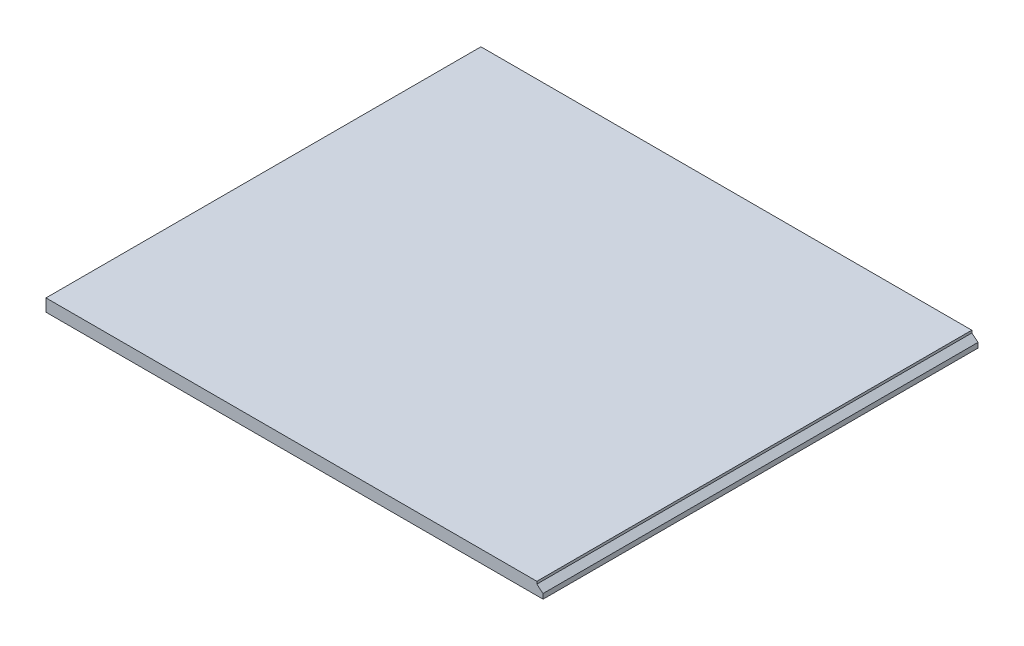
from build123d import *

# Parameters (mm, degrees)
BOSS_EXTRU_1_DEPTH      = 5000
BOSS_EXTRU_1_DEPTH_BACK = 30000
ENL_V_MAT_EXTRU_1_DEPTH = 100


with BuildPart() as part:
    # Esquisse1 → Boss.-Extru.1 (new, two sides: drawn at the far end of the back side and taken through both)
    with BuildSketch(Plane.XY.offset(-BOSS_EXTRU_1_DEPTH_BACK)):
        Polygon((0, 0), (0, -1000), (40000, -1000), (40000, -600), (39500, -200), (39500, 0), align=None)
    extrude(amount=BOSS_EXTRU_1_DEPTH + BOSS_EXTRU_1_DEPTH_BACK)

    # Esquisse2 → Enl_v. mat.-Extru.1 (cut)
    with BuildSketch(Plane(origin=(0, -1000, 0), x_dir=(1, 0, 0), z_dir=(0, 1, 0))):
        with BuildLine():
            Line((5000, 15050), (5000, 15200))
            Line((5000, 15200), (4900, 15200))
            Line((4900, 15200), (4900, 14800))
            Line((4900, 14800), (5000, 14800))
            Line((5000, 14800), (5000, 14950))
            ThreePointArc((5000, 14950), (5050, 15000), (5000, 15050))
        make_face()
    extrude(amount=ENL_V_MAT_EXTRU_1_DEPTH, mode=Mode.SUBTRACT)


solid = part.part
